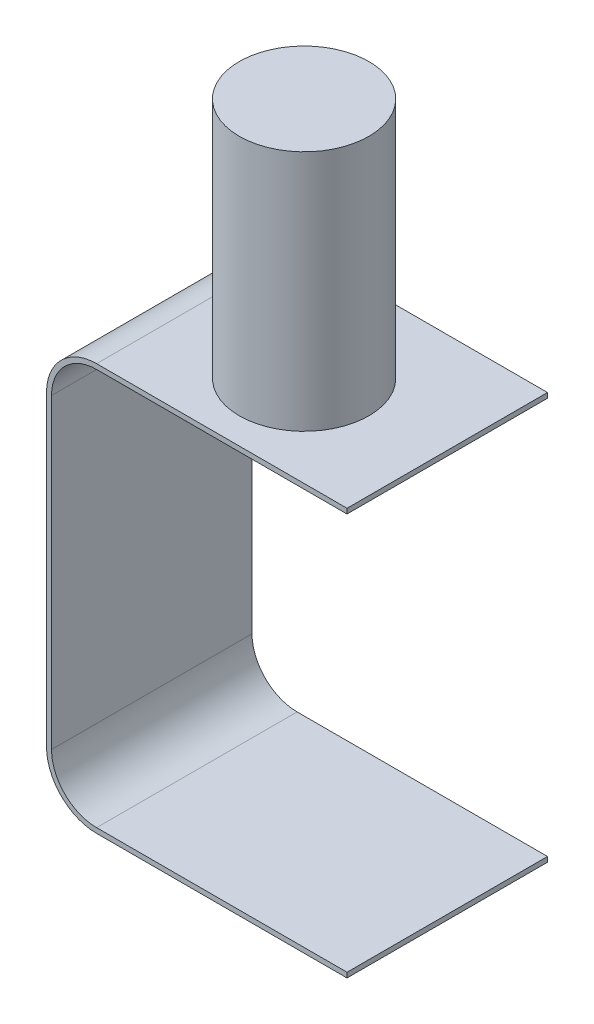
from build123d import *

# Parameters (mm, degrees)
EXTRUDE_THIN1_DEPTH = 101.6
SKETCH3_R           = 32.844132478
EXTRUDE1_DEPTH      = 122.682


with BuildPart() as part:
    # Sketch2 → Extrude-Thin1 (new body)
    with BuildSketch(Plane.XY):
        with BuildLine():
            Line((0, 0), (-126.900580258, 0))
            ThreePointArc((-126.900580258, 0), (-144.8610925, 7.439487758), (-152.300580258, 25.4))
            Line((-152.300580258, 25.4), (-152.300580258, 180.775615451))
            ThreePointArc((-152.300580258, 180.775615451), (-144.8610925, 198.736127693), (-126.900580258, 206.175615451))
            Line((-126.900580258, 206.175615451), (0, 206.175615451))
            Line((0, 206.175615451), (0, 203.635615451))
            Line((0, 203.635615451), (-126.900580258, 203.635615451))
            ThreePointArc((-126.900580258, 203.635615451), (-143.065041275, 196.940076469), (-149.760580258, 180.775615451))
            Line((-149.760580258, 180.775615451), (-149.760580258, 25.4))
            ThreePointArc((-149.760580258, 25.4), (-143.065041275, 9.235538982), (-126.900580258, 2.54))
            Line((-126.900580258, 2.54), (0, 2.54))
            Line((0, 2.54), (0, 0))
        make_face()
    extrude(amount=EXTRUDE_THIN1_DEPTH)


with BuildPart() as body_2:
    # Sketch3 → Extrude1 (new body)
    with BuildSketch(Plane(origin=(0, 206.175615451, 0), x_dir=(1, 0, 0), z_dir=(0, 1, 0))):
        with Locations(Location((-67.848174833, -55.50278332, 0), (0, 0, 270))):
            Circle(SKETCH3_R)
    extrude(amount=EXTRUDE1_DEPTH)


solid = Compound([part.part, body_2.part])
